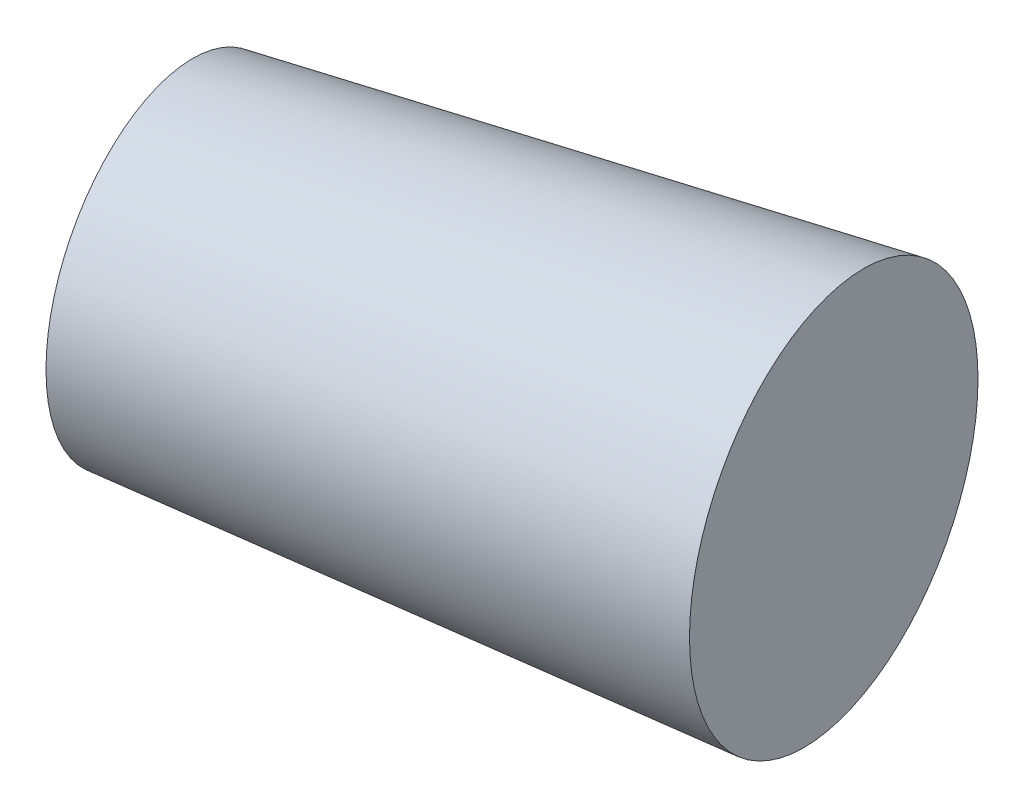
from build123d import *


with BuildPart() as part:
    # Esquisse1 → Base-R_volution (revolve)
    with BuildSketch(Plane(origin=(0, 0, 0), x_dir=(1, 0, 0), z_dir=(0, 1, 0)), mode=Mode.PRIVATE) as base_r_volution_sk:
        Polygon((-6.149960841, -1.330961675), (3.661116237, 0.792331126), (2.947232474, 4.090966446), (-6.752567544, 1.453496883), align=None)
    revolve(base_r_volution_sk.sketch.rotate(Axis((0, 0, 0), (0.977373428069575, 0, -0.21152111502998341)), 180), axis=Axis((0, 0, 0), (0.977373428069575, 0, -0.21152111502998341)))


solid = part.part
